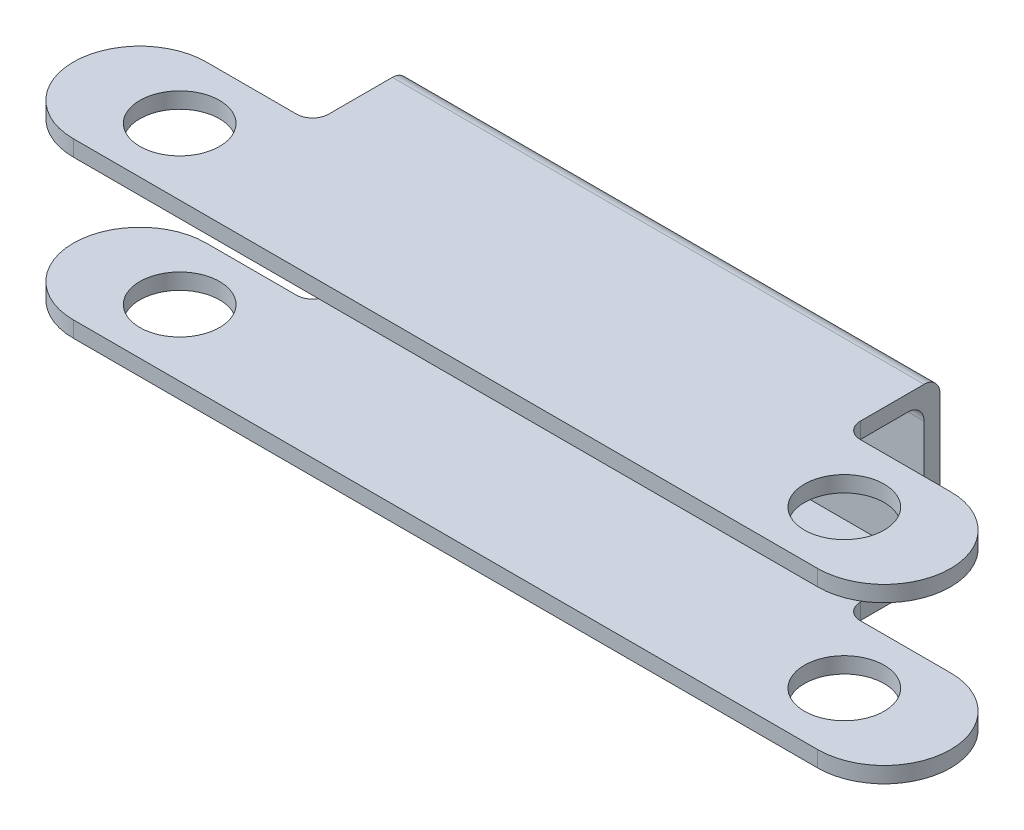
ISO-10303-21;
HEADER;
FILE_DESCRIPTION(('STEP AP214'),'2;1');
FILE_NAME('part.step','',(''),(''),'','','');
FILE_SCHEMA(('AUTOMOTIVE_DESIGN { 1 0 10303 214 1 1 1 1 }'));
ENDSEC;
DATA;
#1=APPLICATION_CONTEXT('core data for automotive mechanical design processes');
#2=APPLICATION_PROTOCOL_DEFINITION('international standard','automotive_design',2000,#1);
#3=PRODUCT_CONTEXT('',#1,'mechanical');
#4=PRODUCT('Part','Part','',(#3));
#5=PRODUCT_RELATED_PRODUCT_CATEGORY('part','',(#4));
#6=PRODUCT_DEFINITION_FORMATION('','',#4);
#7=PRODUCT_DEFINITION_CONTEXT('part definition',#1,'design');
#8=PRODUCT_DEFINITION('design','',#6,#7);
#9=PRODUCT_DEFINITION_SHAPE('','',#8);
#10=(LENGTH_UNIT() NAMED_UNIT(*) SI_UNIT(.MILLI.,.METRE.));
#11=(NAMED_UNIT(*) PLANE_ANGLE_UNIT() SI_UNIT($,.RADIAN.));
#12=(NAMED_UNIT(*) SI_UNIT($,.STERADIAN.) SOLID_ANGLE_UNIT());
#13=UNCERTAINTY_MEASURE_WITH_UNIT(LENGTH_MEASURE(1.E-05),#10,'distance_accuracy_value','');
#14=(GEOMETRIC_REPRESENTATION_CONTEXT(3) GLOBAL_UNCERTAINTY_ASSIGNED_CONTEXT((#13)) GLOBAL_UNIT_ASSIGNED_CONTEXT((#10,
#11,#12)) REPRESENTATION_CONTEXT('',''));
#15=CARTESIAN_POINT('',(0.,0.,0.));
#16=DIRECTION('',(0.,0.,1.));
#17=DIRECTION('',(1.,0.,0.));
#18=AXIS2_PLACEMENT_3D('',#15,#16,#17);
#19=CARTESIAN_POINT('',(-100.,-62.,-55.));
#20=DIRECTION('',(0.,0.,1.));
#21=DIRECTION('',(1.,0.,0.));
#22=AXIS2_PLACEMENT_3D('',#19,#20,#21);
#23=PLANE('',#22);
#24=DIRECTION('',(0.,1.,0.));
#25=VECTOR('',#24,1.);
#26=CARTESIAN_POINT('',(-100.,-62.,-55.));
#27=LINE('',#26,#25);
#28=CARTESIAN_POINT('',(-100.,-53.,-55.));
#29=VERTEX_POINT('',#28);
#30=CARTESIAN_POINT('',(-100.,-6.,-55.));
#31=VERTEX_POINT('',#30);
#32=EDGE_CURVE('E34',#29,#31,#27,.T.);
#33=ORIENTED_EDGE('',*,*,#32,.F.);
#34=DIRECTION('',(-1.,0.,0.));
#35=VECTOR('',#34,1.);
#36=CARTESIAN_POINT('',(-100.,-53.,-55.));
#37=LINE('',#36,#35);
#38=CARTESIAN_POINT('',(100.,-53.,-55.));
#39=VERTEX_POINT('',#38);
#40=EDGE_CURVE('E254',#39,#29,#37,.T.);
#41=ORIENTED_EDGE('',*,*,#40,.F.);
#42=DIRECTION('',(0.,1.,0.));
#43=VECTOR('',#42,1.);
#44=CARTESIAN_POINT('',(100.,-62.,-55.));
#45=LINE('',#44,#43);
#46=CARTESIAN_POINT('',(100.,-6.,-55.));
#47=VERTEX_POINT('',#46);
#48=EDGE_CURVE('E309',#39,#47,#45,.T.);
#49=ORIENTED_EDGE('',*,*,#48,.T.);
#50=DIRECTION('',(-1.,0.,0.));
#51=VECTOR('',#50,1.);
#52=CARTESIAN_POINT('',(-100.,-6.,-55.));
#53=LINE('',#52,#51);
#54=EDGE_CURVE('E313',#47,#31,#53,.T.);
#55=ORIENTED_EDGE('',*,*,#54,.T.);
#56=EDGE_LOOP('',(#33,#41,#49,#55));
#57=FACE_BOUND('',#56,.T.);
#58=ADVANCED_FACE('F30',(#57),#23,.T.);
#59=CARTESIAN_POINT('',(-106.,6.,-31.));
#60=DIRECTION('',(0.,1.,0.));
#61=DIRECTION('',(0.,0.,1.));
#62=AXIS2_PLACEMENT_3D('',#59,#60,#61);
#63=PLANE('',#62);
#64=CARTESIAN_POINT('',(-125.,6.,0.));
#65=DIRECTION('',(0.,1.,0.));
#66=DIRECTION('',(0.,0.,1.));
#67=AXIS2_PLACEMENT_3D('',#64,#65,#66);
#68=CIRCLE('',#67,15.);
#69=CARTESIAN_POINT('',(-125.,6.,15.));
#70=VERTEX_POINT('',#69);
#71=EDGE_CURVE('E360',#70,#70,#68,.T.);
#72=ORIENTED_EDGE('',*,*,#71,.F.);
#73=EDGE_LOOP('',(#72));
#74=FACE_BOUND('',#73,.T.);
#75=DIRECTION('',(0.,0.,-1.));
#76=VECTOR('',#75,1.);
#77=CARTESIAN_POINT('',(100.,6.,-55.));
#78=LINE('',#77,#76);
#79=CARTESIAN_POINT('',(100.,6.,-31.));
#80=VERTEX_POINT('',#79);
#81=CARTESIAN_POINT('',(100.,6.,-55.));
#82=VERTEX_POINT('',#81);
#83=EDGE_CURVE('E420',#80,#82,#78,.T.);
#84=ORIENTED_EDGE('',*,*,#83,.T.);
#85=DIRECTION('',(-1.,0.,0.));
#86=VECTOR('',#85,1.);
#87=CARTESIAN_POINT('',(-106.,6.,-55.));
#88=LINE('',#87,#86);
#89=CARTESIAN_POINT('',(-100.,6.,-55.));
#90=VERTEX_POINT('',#89);
#91=EDGE_CURVE('E329',#82,#90,#88,.T.);
#92=ORIENTED_EDGE('',*,*,#91,.T.);
#93=DIRECTION('',(0.,0.,1.));
#94=VECTOR('',#93,1.);
#95=CARTESIAN_POINT('',(-100.,6.,-31.));
#96=LINE('',#95,#94);
#97=CARTESIAN_POINT('',(-100.,6.,-31.));
#98=VERTEX_POINT('',#97);
#99=EDGE_CURVE('E368',#90,#98,#96,.T.);
#100=ORIENTED_EDGE('',*,*,#99,.T.);
#101=CARTESIAN_POINT('',(-106.,6.,-31.));
#102=DIRECTION('',(0.,-1.,0.));
#103=DIRECTION('',(0.,0.,1.));
#104=AXIS2_PLACEMENT_3D('',#101,#102,#103);
#105=CIRCLE('',#104,5.99999999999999);
#106=CARTESIAN_POINT('',(-106.,6.,-25.));
#107=VERTEX_POINT('',#106);
#108=EDGE_CURVE('E317',#98,#107,#105,.T.);
#109=ORIENTED_EDGE('',*,*,#108,.T.);
#110=DIRECTION('',(-1.,0.,0.));
#111=VECTOR('',#110,1.);
#112=CARTESIAN_POINT('',(-140.,6.,-25.));
#113=LINE('',#112,#111);
#114=CARTESIAN_POINT('',(-140.,6.,-25.));
#115=VERTEX_POINT('',#114);
#116=EDGE_CURVE('E402',#107,#115,#113,.T.);
#117=ORIENTED_EDGE('',*,*,#116,.T.);
#118=CARTESIAN_POINT('',(-140.,6.,0.));
#119=DIRECTION('',(0.,1.,0.));
#120=DIRECTION('',(0.,0.,1.));
#121=AXIS2_PLACEMENT_3D('',#118,#119,#120);
#122=CIRCLE('',#121,25.);
#123=CARTESIAN_POINT('',(-140.,6.,25.));
#124=VERTEX_POINT('',#123);
#125=EDGE_CURVE('E408',#115,#124,#122,.T.);
#126=ORIENTED_EDGE('',*,*,#125,.T.);
#127=DIRECTION('',(1.,0.,0.));
#128=VECTOR('',#127,1.);
#129=CARTESIAN_POINT('',(-140.,6.,25.));
#130=LINE('',#129,#128);
#131=CARTESIAN_POINT('',(140.,6.,25.));
#132=VERTEX_POINT('',#131);
#133=EDGE_CURVE('E413',#124,#132,#130,.T.);
#134=ORIENTED_EDGE('',*,*,#133,.T.);
#135=CARTESIAN_POINT('',(140.,6.,0.));
#136=DIRECTION('',(0.,1.,0.));
#137=DIRECTION('',(0.,0.,1.));
#138=AXIS2_PLACEMENT_3D('',#135,#136,#137);
#139=CIRCLE('',#138,25.);
#140=CARTESIAN_POINT('',(140.,6.,-24.9999999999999));
#141=VERTEX_POINT('',#140);
#142=EDGE_CURVE('E415',#132,#141,#139,.T.);
#143=ORIENTED_EDGE('',*,*,#142,.T.);
#144=DIRECTION('',(-1.,0.,0.));
#145=VECTOR('',#144,1.);
#146=CARTESIAN_POINT('',(106.,6.,-25.));
#147=LINE('',#146,#145);
#148=CARTESIAN_POINT('',(106.,6.,-25.));
#149=VERTEX_POINT('',#148);
#150=EDGE_CURVE('E417',#141,#149,#147,.T.);
#151=ORIENTED_EDGE('',*,*,#150,.T.);
#152=CARTESIAN_POINT('',(106.,6.,-31.));
#153=DIRECTION('',(0.,-1.,0.));
#154=DIRECTION('',(0.,0.,1.));
#155=AXIS2_PLACEMENT_3D('',#152,#153,#154);
#156=CIRCLE('',#155,6.00000000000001);
#157=EDGE_CURVE('E419',#149,#80,#156,.T.);
#158=ORIENTED_EDGE('',*,*,#157,.T.);
#159=EDGE_LOOP('',(#84,#92,#100,#109,#117,#126,#134,#143,#151,#158));
#160=FACE_BOUND('',#159,.T.);
#161=CARTESIAN_POINT('',(125.,6.,0.));
#162=DIRECTION('',(0.,1.,0.));
#163=DIRECTION('',(0.,0.,1.));
#164=AXIS2_PLACEMENT_3D('',#161,#162,#163);
#165=CIRCLE('',#164,15.);
#166=CARTESIAN_POINT('',(125.,6.,15.));
#167=VERTEX_POINT('',#166);
#168=EDGE_CURVE('E771',#167,#167,#165,.T.);
#169=ORIENTED_EDGE('',*,*,#168,.F.);
#170=EDGE_LOOP('',(#169));
#171=FACE_BOUND('',#170,.T.);
#172=ADVANCED_FACE('F422',(#74,#160,#171),#63,.T.);
#173=CARTESIAN_POINT('',(-106.,0.,-31.));
#174=DIRECTION('',(0.,1.,0.));
#175=DIRECTION('',(0.,0.,1.));
#176=AXIS2_PLACEMENT_3D('',#173,#174,#175);
#177=PLANE('',#176);
#178=CARTESIAN_POINT('',(-125.,0.,0.));
#179=DIRECTION('',(0.,1.,0.));
#180=DIRECTION('',(0.,0.,1.));
#181=AXIS2_PLACEMENT_3D('',#178,#179,#180);
#182=CIRCLE('',#181,15.);
#183=CARTESIAN_POINT('',(-125.,0.,15.));
#184=VERTEX_POINT('',#183);
#185=EDGE_CURVE('E365',#184,#184,#182,.T.);
#186=ORIENTED_EDGE('',*,*,#185,.T.);
#187=EDGE_LOOP('',(#186));
#188=FACE_BOUND('',#187,.T.);
#189=DIRECTION('',(0.,0.,1.));
#190=VECTOR('',#189,1.);
#191=CARTESIAN_POINT('',(-100.,0.,-31.));
#192=LINE('',#191,#190);
#193=CARTESIAN_POINT('',(-100.,0.,-49.));
#194=VERTEX_POINT('',#193);
#195=CARTESIAN_POINT('',(-100.,0.,-31.));
#196=VERTEX_POINT('',#195);
#197=EDGE_CURVE('E314',#194,#196,#192,.T.);
#198=ORIENTED_EDGE('',*,*,#197,.F.);
#199=DIRECTION('',(-1.,0.,0.));
#200=VECTOR('',#199,1.);
#201=CARTESIAN_POINT('',(-106.,0.,-49.));
#202=LINE('',#201,#200);
#203=CARTESIAN_POINT('',(100.,0.,-49.));
#204=VERTEX_POINT('',#203);
#205=EDGE_CURVE('E56',#194,#204,#202,.F.);
#206=ORIENTED_EDGE('',*,*,#205,.T.);
#207=DIRECTION('',(0.,0.,-1.));
#208=VECTOR('',#207,1.);
#209=CARTESIAN_POINT('',(100.,0.,-55.));
#210=LINE('',#209,#208);
#211=CARTESIAN_POINT('',(100.,0.,-31.));
#212=VERTEX_POINT('',#211);
#213=EDGE_CURVE('E318',#212,#204,#210,.T.);
#214=ORIENTED_EDGE('',*,*,#213,.F.);
#215=CARTESIAN_POINT('',(106.,0.,-31.));
#216=DIRECTION('',(0.,-1.,0.));
#217=DIRECTION('',(0.,0.,1.));
#218=AXIS2_PLACEMENT_3D('',#215,#216,#217);
#219=CIRCLE('',#218,6.00000000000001);
#220=CARTESIAN_POINT('',(106.,0.,-25.));
#221=VERTEX_POINT('',#220);
#222=EDGE_CURVE('E326',#221,#212,#219,.T.);
#223=ORIENTED_EDGE('',*,*,#222,.F.);
#224=DIRECTION('',(-1.,0.,0.));
#225=VECTOR('',#224,1.);
#226=CARTESIAN_POINT('',(106.,0.,-25.));
#227=LINE('',#226,#225);
#228=CARTESIAN_POINT('',(140.,0.,-24.9999999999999));
#229=VERTEX_POINT('',#228);
#230=EDGE_CURVE('E376',#229,#221,#227,.T.);
#231=ORIENTED_EDGE('',*,*,#230,.F.);
#232=CARTESIAN_POINT('',(140.,0.,0.));
#233=DIRECTION('',(0.,1.,0.));
#234=DIRECTION('',(0.,0.,1.));
#235=AXIS2_PLACEMENT_3D('',#232,#233,#234);
#236=CIRCLE('',#235,25.);
#237=CARTESIAN_POINT('',(140.,0.,25.));
#238=VERTEX_POINT('',#237);
#239=EDGE_CURVE('E374',#238,#229,#236,.T.);
#240=ORIENTED_EDGE('',*,*,#239,.F.);
#241=DIRECTION('',(1.,0.,0.));
#242=VECTOR('',#241,1.);
#243=CARTESIAN_POINT('',(-140.,0.,25.));
#244=LINE('',#243,#242);
#245=CARTESIAN_POINT('',(-140.,0.,25.));
#246=VERTEX_POINT('',#245);
#247=EDGE_CURVE('E372',#246,#238,#244,.T.);
#248=ORIENTED_EDGE('',*,*,#247,.F.);
#249=CARTESIAN_POINT('',(-140.,0.,0.));
#250=DIRECTION('',(0.,1.,0.));
#251=DIRECTION('',(0.,0.,1.));
#252=AXIS2_PLACEMENT_3D('',#249,#250,#251);
#253=CIRCLE('',#252,25.);
#254=CARTESIAN_POINT('',(-140.,0.,-25.));
#255=VERTEX_POINT('',#254);
#256=EDGE_CURVE('E362',#255,#246,#253,.T.);
#257=ORIENTED_EDGE('',*,*,#256,.F.);
#258=DIRECTION('',(-1.,0.,0.));
#259=VECTOR('',#258,1.);
#260=CARTESIAN_POINT('',(-140.,0.,-25.));
#261=LINE('',#260,#259);
#262=CARTESIAN_POINT('',(-106.,0.,-25.));
#263=VERTEX_POINT('',#262);
#264=EDGE_CURVE('E356',#263,#255,#261,.T.);
#265=ORIENTED_EDGE('',*,*,#264,.F.);
#266=CARTESIAN_POINT('',(-106.,0.,-31.));
#267=DIRECTION('',(0.,-1.,0.));
#268=DIRECTION('',(0.,0.,1.));
#269=AXIS2_PLACEMENT_3D('',#266,#267,#268);
#270=CIRCLE('',#269,5.99999999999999);
#271=EDGE_CURVE('E354',#196,#263,#270,.T.);
#272=ORIENTED_EDGE('',*,*,#271,.F.);
#273=EDGE_LOOP('',(#198,#206,#214,#223,#231,#240,#248,#257,#265,#272));
#274=FACE_BOUND('',#273,.T.);
#275=CARTESIAN_POINT('',(125.,0.,0.));
#276=DIRECTION('',(0.,1.,0.));
#277=DIRECTION('',(0.,0.,1.));
#278=AXIS2_PLACEMENT_3D('',#275,#276,#277);
#279=CIRCLE('',#278,15.);
#280=CARTESIAN_POINT('',(125.,0.,15.));
#281=VERTEX_POINT('',#280);
#282=EDGE_CURVE('E298',#281,#281,#279,.T.);
#283=ORIENTED_EDGE('',*,*,#282,.T.);
#284=EDGE_LOOP('',(#283));
#285=FACE_BOUND('',#284,.T.);
#286=ADVANCED_FACE('F351',(#188,#274,#285),#177,.F.);
#287=CARTESIAN_POINT('',(-106.,6.,-31.));
#288=DIRECTION('',(0.,-1.,0.));
#289=DIRECTION('',(0.,0.,-1.));
#290=AXIS2_PLACEMENT_3D('',#287,#288,#289);
#291=CYLINDRICAL_SURFACE('',#290,5.99999999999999);
#292=ORIENTED_EDGE('',*,*,#271,.T.);
#293=DIRECTION('',(0.,-1.,0.));
#294=VECTOR('',#293,1.);
#295=CARTESIAN_POINT('',(-106.,6.,-25.));
#296=LINE('',#295,#294);
#297=EDGE_CURVE('E323',#107,#263,#296,.T.);
#298=ORIENTED_EDGE('',*,*,#297,.F.);
#299=ORIENTED_EDGE('',*,*,#108,.F.);
#300=DIRECTION('',(0.,-1.,0.));
#301=VECTOR('',#300,1.);
#302=CARTESIAN_POINT('',(-100.,6.,-31.));
#303=LINE('',#302,#301);
#304=EDGE_CURVE('E379',#98,#196,#303,.T.);
#305=ORIENTED_EDGE('',*,*,#304,.T.);
#306=EDGE_LOOP('',(#292,#298,#299,#305));
#307=FACE_BOUND('',#306,.T.);
#308=ADVANCED_FACE('F405',(#307),#291,.F.);
#309=CARTESIAN_POINT('',(-140.,6.,-25.));
#310=DIRECTION('',(0.,0.,1.));
#311=DIRECTION('',(1.,0.,0.));
#312=AXIS2_PLACEMENT_3D('',#309,#310,#311);
#313=PLANE('',#312);
#314=ORIENTED_EDGE('',*,*,#264,.T.);
#315=DIRECTION('',(0.,-1.,0.));
#316=VECTOR('',#315,1.);
#317=CARTESIAN_POINT('',(-140.,6.,-25.));
#318=LINE('',#317,#316);
#319=EDGE_CURVE('E395',#115,#255,#318,.T.);
#320=ORIENTED_EDGE('',*,*,#319,.F.);
#321=ORIENTED_EDGE('',*,*,#116,.F.);
#322=ORIENTED_EDGE('',*,*,#297,.T.);
#323=EDGE_LOOP('',(#314,#320,#321,#322));
#324=FACE_BOUND('',#323,.T.);
#325=ADVANCED_FACE('F401',(#324),#313,.F.);
#326=CARTESIAN_POINT('',(-140.,6.,0.));
#327=DIRECTION('',(0.,-1.,0.));
#328=DIRECTION('',(0.,0.,-1.));
#329=AXIS2_PLACEMENT_3D('',#326,#327,#328);
#330=CYLINDRICAL_SURFACE('',#329,25.);
#331=ORIENTED_EDGE('',*,*,#256,.T.);
#332=DIRECTION('',(0.,-1.,0.));
#333=VECTOR('',#332,1.);
#334=CARTESIAN_POINT('',(-140.,6.,25.));
#335=LINE('',#334,#333);
#336=EDGE_CURVE('E393',#124,#246,#335,.T.);
#337=ORIENTED_EDGE('',*,*,#336,.F.);
#338=ORIENTED_EDGE('',*,*,#125,.F.);
#339=ORIENTED_EDGE('',*,*,#319,.T.);
#340=EDGE_LOOP('',(#331,#337,#338,#339));
#341=FACE_BOUND('',#340,.T.);
#342=ADVANCED_FACE('F505',(#341),#330,.T.);
#343=CARTESIAN_POINT('',(-140.,6.,25.));
#344=DIRECTION('',(0.,0.,-1.));
#345=DIRECTION('',(-1.,0.,0.));
#346=AXIS2_PLACEMENT_3D('',#343,#344,#345);
#347=PLANE('',#346);
#348=ORIENTED_EDGE('',*,*,#247,.T.);
#349=DIRECTION('',(0.,-1.,0.));
#350=VECTOR('',#349,1.);
#351=CARTESIAN_POINT('',(140.,6.,25.));
#352=LINE('',#351,#350);
#353=EDGE_CURVE('E390',#132,#238,#352,.T.);
#354=ORIENTED_EDGE('',*,*,#353,.F.);
#355=ORIENTED_EDGE('',*,*,#133,.F.);
#356=ORIENTED_EDGE('',*,*,#336,.T.);
#357=EDGE_LOOP('',(#348,#354,#355,#356));
#358=FACE_BOUND('',#357,.T.);
#359=ADVANCED_FACE('F502',(#358),#347,.F.);
#360=CARTESIAN_POINT('',(140.,6.,0.));
#361=DIRECTION('',(0.,-1.,0.));
#362=DIRECTION('',(0.,0.,-1.));
#363=AXIS2_PLACEMENT_3D('',#360,#361,#362);
#364=CYLINDRICAL_SURFACE('',#363,25.);
#365=ORIENTED_EDGE('',*,*,#239,.T.);
#366=DIRECTION('',(0.,-1.,0.));
#367=VECTOR('',#366,1.);
#368=CARTESIAN_POINT('',(140.,6.,-24.9999999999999));
#369=LINE('',#368,#367);
#370=EDGE_CURVE('E387',#141,#229,#369,.T.);
#371=ORIENTED_EDGE('',*,*,#370,.F.);
#372=ORIENTED_EDGE('',*,*,#142,.F.);
#373=ORIENTED_EDGE('',*,*,#353,.T.);
#374=EDGE_LOOP('',(#365,#371,#372,#373));
#375=FACE_BOUND('',#374,.T.);
#376=ADVANCED_FACE('F498',(#375),#364,.T.);
#377=CARTESIAN_POINT('',(106.,6.,-25.));
#378=DIRECTION('',(0.,0.,1.));
#379=DIRECTION('',(1.,0.,0.));
#380=AXIS2_PLACEMENT_3D('',#377,#378,#379);
#381=PLANE('',#380);
#382=ORIENTED_EDGE('',*,*,#230,.T.);
#383=DIRECTION('',(0.,-1.,0.));
#384=VECTOR('',#383,1.);
#385=CARTESIAN_POINT('',(106.,6.,-25.));
#386=LINE('',#385,#384);
#387=EDGE_CURVE('E384',#149,#221,#386,.T.);
#388=ORIENTED_EDGE('',*,*,#387,.F.);
#389=ORIENTED_EDGE('',*,*,#150,.F.);
#390=ORIENTED_EDGE('',*,*,#370,.T.);
#391=EDGE_LOOP('',(#382,#388,#389,#390));
#392=FACE_BOUND('',#391,.T.);
#393=ADVANCED_FACE('F494',(#392),#381,.F.);
#394=CARTESIAN_POINT('',(106.,6.,-31.));
#395=DIRECTION('',(0.,-1.,0.));
#396=DIRECTION('',(0.,0.,-1.));
#397=AXIS2_PLACEMENT_3D('',#394,#395,#396);
#398=CYLINDRICAL_SURFACE('',#397,6.00000000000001);
#399=ORIENTED_EDGE('',*,*,#222,.T.);
#400=DIRECTION('',(0.,-1.,0.));
#401=VECTOR('',#400,1.);
#402=CARTESIAN_POINT('',(100.,6.,-31.));
#403=LINE('',#402,#401);
#404=EDGE_CURVE('E381',#80,#212,#403,.T.);
#405=ORIENTED_EDGE('',*,*,#404,.F.);
#406=ORIENTED_EDGE('',*,*,#157,.F.);
#407=ORIENTED_EDGE('',*,*,#387,.T.);
#408=EDGE_LOOP('',(#399,#405,#406,#407));
#409=FACE_BOUND('',#408,.T.);
#410=ADVANCED_FACE('F489',(#409),#398,.F.);
#411=CARTESIAN_POINT('',(100.,6.,-55.));
#412=DIRECTION('',(-1.,0.,0.));
#413=DIRECTION('',(0.,0.,1.));
#414=AXIS2_PLACEMENT_3D('',#411,#412,#413);
#415=PLANE('',#414);
#416=DIRECTION('',(0.,1.,0.));
#417=VECTOR('',#416,1.);
#418=CARTESIAN_POINT('',(100.,-62.,-61.));
#419=LINE('',#418,#417);
#420=CARTESIAN_POINT('',(100.,-62.,-61.));
#421=VERTEX_POINT('',#420);
#422=CARTESIAN_POINT('',(100.,0.,-61.));
#423=VERTEX_POINT('',#422);
#424=EDGE_CURVE('E299',#421,#423,#419,.T.);
#425=ORIENTED_EDGE('',*,*,#424,.T.);
#426=CARTESIAN_POINT('',(100.,0.,-55.));
#427=DIRECTION('',(-1.,0.,0.));
#428=DIRECTION('',(0.,0.,1.));
#429=AXIS2_PLACEMENT_3D('',#426,#427,#428);
#430=CIRCLE('',#429,6.);
#431=EDGE_CURVE('E335',#423,#82,#430,.F.);
#432=ORIENTED_EDGE('',*,*,#431,.T.);
#433=ORIENTED_EDGE('',*,*,#83,.F.);
#434=ORIENTED_EDGE('',*,*,#404,.T.);
#435=ORIENTED_EDGE('',*,*,#213,.T.);
#436=CARTESIAN_POINT('',(100.,-6.,-49.));
#437=DIRECTION('',(-1.,0.,0.));
#438=DIRECTION('',(0.,0.,1.));
#439=AXIS2_PLACEMENT_3D('',#436,#437,#438);
#440=CIRCLE('',#439,6.);
#441=EDGE_CURVE('E11',#204,#47,#440,.T.);
#442=ORIENTED_EDGE('',*,*,#441,.T.);
#443=ORIENTED_EDGE('',*,*,#48,.F.);
#444=DIRECTION('',(0.,0.,-1.));
#445=VECTOR('',#444,1.);
#446=CARTESIAN_POINT('',(100.,-53.,-55.));
#447=LINE('',#446,#445);
#448=CARTESIAN_POINT('',(100.,-53.,-31.));
#449=VERTEX_POINT('',#448);
#450=EDGE_CURVE('E48',#449,#39,#447,.T.);
#451=ORIENTED_EDGE('',*,*,#450,.F.);
#452=DIRECTION('',(0.,1.,0.));
#453=VECTOR('',#452,1.);
#454=CARTESIAN_POINT('',(100.,-59.,-31.));
#455=LINE('',#454,#453);
#456=CARTESIAN_POINT('',(100.,-59.,-31.));
#457=VERTEX_POINT('',#456);
#458=EDGE_CURVE('E209',#457,#449,#455,.T.);
#459=ORIENTED_EDGE('',*,*,#458,.F.);
#460=DIRECTION('',(0.,0.,-1.));
#461=VECTOR('',#460,1.);
#462=CARTESIAN_POINT('',(100.,-59.,-55.));
#463=LINE('',#462,#461);
#464=CARTESIAN_POINT('',(100.,-59.,-55.));
#465=VERTEX_POINT('',#464);
#466=EDGE_CURVE('E227',#457,#465,#463,.T.);
#467=ORIENTED_EDGE('',*,*,#466,.T.);
#468=CARTESIAN_POINT('',(100.,-62.,-55.));
#469=VERTEX_POINT('',#468);
#470=EDGE_CURVE('E302',#469,#465,#45,.T.);
#471=ORIENTED_EDGE('',*,*,#470,.F.);
#472=DIRECTION('',(0.,0.,-1.));
#473=VECTOR('',#472,1.);
#474=CARTESIAN_POINT('',(100.,-62.,-55.));
#475=LINE('',#474,#473);
#476=EDGE_CURVE('E289',#469,#421,#475,.T.);
#477=ORIENTED_EDGE('',*,*,#476,.T.);
#478=EDGE_LOOP('',(#425,#432,#433,#434,#435,#442,#443,#451,#459,#467,#471,#477));
#479=FACE_BOUND('',#478,.T.);
#480=ADVANCED_FACE('F460',(#479),#415,.F.);
#481=CARTESIAN_POINT('',(-100.,6.,-31.));
#482=DIRECTION('',(1.,0.,0.));
#483=DIRECTION('',(0.,0.,-1.));
#484=AXIS2_PLACEMENT_3D('',#481,#482,#483);
#485=PLANE('',#484);
#486=ORIENTED_EDGE('',*,*,#99,.F.);
#487=CARTESIAN_POINT('',(-100.,0.,-55.));
#488=DIRECTION('',(1.,0.,0.));
#489=DIRECTION('',(0.,0.,-1.));
#490=AXIS2_PLACEMENT_3D('',#487,#488,#489);
#491=CIRCLE('',#490,6.);
#492=CARTESIAN_POINT('',(-100.,0.,-61.));
#493=VERTEX_POINT('',#492);
#494=EDGE_CURVE('E332',#90,#493,#491,.F.);
#495=ORIENTED_EDGE('',*,*,#494,.T.);
#496=DIRECTION('',(0.,1.,0.));
#497=VECTOR('',#496,1.);
#498=CARTESIAN_POINT('',(-100.,-62.,-61.));
#499=LINE('',#498,#497);
#500=CARTESIAN_POINT('',(-100.,-62.,-61.));
#501=VERTEX_POINT('',#500);
#502=EDGE_CURVE('E295',#501,#493,#499,.T.);
#503=ORIENTED_EDGE('',*,*,#502,.F.);
#504=DIRECTION('',(0.,0.,1.));
#505=VECTOR('',#504,1.);
#506=CARTESIAN_POINT('',(-100.,-62.,-55.));
#507=LINE('',#506,#505);
#508=CARTESIAN_POINT('',(-100.,-62.,-55.));
#509=VERTEX_POINT('',#508);
#510=EDGE_CURVE('E208',#501,#509,#507,.T.);
#511=ORIENTED_EDGE('',*,*,#510,.T.);
#512=CARTESIAN_POINT('',(-100.,-59.,-55.));
#513=VERTEX_POINT('',#512);
#514=EDGE_CURVE('E224',#509,#513,#27,.T.);
#515=ORIENTED_EDGE('',*,*,#514,.T.);
#516=DIRECTION('',(0.,0.,1.));
#517=VECTOR('',#516,1.);
#518=CARTESIAN_POINT('',(-100.,-59.,-31.));
#519=LINE('',#518,#517);
#520=CARTESIAN_POINT('',(-100.,-59.,-31.));
#521=VERTEX_POINT('',#520);
#522=EDGE_CURVE('E213',#513,#521,#519,.T.);
#523=ORIENTED_EDGE('',*,*,#522,.T.);
#524=DIRECTION('',(0.,1.,0.));
#525=VECTOR('',#524,1.);
#526=CARTESIAN_POINT('',(-100.,-59.,-31.));
#527=LINE('',#526,#525);
#528=CARTESIAN_POINT('',(-100.,-53.,-31.));
#529=VERTEX_POINT('',#528);
#530=EDGE_CURVE('E198',#521,#529,#527,.T.);
#531=ORIENTED_EDGE('',*,*,#530,.T.);
#532=DIRECTION('',(0.,0.,1.));
#533=VECTOR('',#532,1.);
#534=CARTESIAN_POINT('',(-100.,-53.,-31.));
#535=LINE('',#534,#533);
#536=EDGE_CURVE('E251',#29,#529,#535,.T.);
#537=ORIENTED_EDGE('',*,*,#536,.F.);
#538=ORIENTED_EDGE('',*,*,#32,.T.);
#539=CARTESIAN_POINT('',(-100.,-6.,-49.));
#540=DIRECTION('',(1.,0.,0.));
#541=DIRECTION('',(0.,0.,-1.));
#542=AXIS2_PLACEMENT_3D('',#539,#540,#541);
#543=CIRCLE('',#542,6.);
#544=EDGE_CURVE('E40',#31,#194,#543,.T.);
#545=ORIENTED_EDGE('',*,*,#544,.T.);
#546=ORIENTED_EDGE('',*,*,#197,.T.);
#547=ORIENTED_EDGE('',*,*,#304,.F.);
#548=EDGE_LOOP('',(#486,#495,#503,#511,#515,#523,#531,#537,#538,#545,#546,#547));
#549=FACE_BOUND('',#548,.T.);
#550=ADVANCED_FACE('F222',(#549),#485,.F.);
#551=CARTESIAN_POINT('',(-125.,6.,0.));
#552=DIRECTION('',(0.,-1.,0.));
#553=DIRECTION('',(0.,0.,-1.));
#554=AXIS2_PLACEMENT_3D('',#551,#552,#553);
#555=CYLINDRICAL_SURFACE('',#554,15.);
#556=ORIENTED_EDGE('',*,*,#71,.T.);
#557=EDGE_LOOP('',(#556));
#558=FACE_BOUND('',#557,.T.);
#559=ORIENTED_EDGE('',*,*,#185,.F.);
#560=EDGE_LOOP('',(#559));
#561=FACE_BOUND('',#560,.T.);
#562=ADVANCED_FACE('F528',(#558,#561),#555,.F.);
#563=CARTESIAN_POINT('',(125.,6.,0.));
#564=DIRECTION('',(0.,-1.,0.));
#565=DIRECTION('',(0.,0.,-1.));
#566=AXIS2_PLACEMENT_3D('',#563,#564,#565);
#567=CYLINDRICAL_SURFACE('',#566,15.);
#568=ORIENTED_EDGE('',*,*,#168,.T.);
#569=EDGE_LOOP('',(#568));
#570=FACE_BOUND('',#569,.T.);
#571=ORIENTED_EDGE('',*,*,#282,.F.);
#572=EDGE_LOOP('',(#571));
#573=FACE_BOUND('',#572,.T.);
#574=ADVANCED_FACE('F455',(#570,#573),#567,.F.);
#575=CARTESIAN_POINT('',(-100.,-62.,-61.));
#576=DIRECTION('',(0.,0.,-1.));
#577=DIRECTION('',(-1.,0.,0.));
#578=AXIS2_PLACEMENT_3D('',#575,#576,#577);
#579=PLANE('',#578);
#580=ORIENTED_EDGE('',*,*,#502,.T.);
#581=DIRECTION('',(-1.,0.,0.));
#582=VECTOR('',#581,1.);
#583=CARTESIAN_POINT('',(-100.,0.,-61.));
#584=LINE('',#583,#582);
#585=EDGE_CURVE('E334',#493,#423,#584,.F.);
#586=ORIENTED_EDGE('',*,*,#585,.T.);
#587=ORIENTED_EDGE('',*,*,#424,.F.);
#588=DIRECTION('',(-1.,0.,0.));
#589=VECTOR('',#588,1.);
#590=CARTESIAN_POINT('',(-100.,-62.,-61.));
#591=LINE('',#590,#589);
#592=EDGE_CURVE('E292',#421,#501,#591,.T.);
#593=ORIENTED_EDGE('',*,*,#592,.T.);
#594=EDGE_LOOP('',(#580,#586,#587,#593));
#595=FACE_BOUND('',#594,.T.);
#596=ADVANCED_FACE('F428',(#595),#579,.T.);
#597=DIRECTION('',(-1.,0.,0.));
#598=VECTOR('',#597,1.);
#599=CARTESIAN_POINT('',(-100.,-59.,-55.));
#600=LINE('',#599,#598);
#601=EDGE_CURVE('E225',#465,#513,#600,.T.);
#602=ORIENTED_EDGE('',*,*,#601,.T.);
#603=ORIENTED_EDGE('',*,*,#514,.F.);
#604=DIRECTION('',(1.,0.,0.));
#605=VECTOR('',#604,1.);
#606=CARTESIAN_POINT('',(-100.,-62.,-55.));
#607=LINE('',#606,#605);
#608=EDGE_CURVE('E286',#509,#469,#607,.T.);
#609=ORIENTED_EDGE('',*,*,#608,.T.);
#610=ORIENTED_EDGE('',*,*,#470,.T.);
#611=EDGE_LOOP('',(#602,#603,#609,#610));
#612=FACE_BOUND('',#611,.T.);
#613=ADVANCED_FACE('F437',(#612),#23,.T.);
#614=CARTESIAN_POINT('',(-100.,-62.,-61.));
#615=DIRECTION('',(0.,-1.,0.));
#616=DIRECTION('',(0.,0.,-1.));
#617=AXIS2_PLACEMENT_3D('',#614,#615,#616);
#618=PLANE('',#617);
#619=ORIENTED_EDGE('',*,*,#510,.F.);
#620=ORIENTED_EDGE('',*,*,#592,.F.);
#621=ORIENTED_EDGE('',*,*,#476,.F.);
#622=ORIENTED_EDGE('',*,*,#608,.F.);
#623=EDGE_LOOP('',(#619,#620,#621,#622));
#624=FACE_BOUND('',#623,.T.);
#625=ADVANCED_FACE('F432',(#624),#618,.T.);
#626=CARTESIAN_POINT('',(-106.,0.,-55.));
#627=DIRECTION('',(-1.,0.,0.));
#628=DIRECTION('',(0.,0.,1.));
#629=AXIS2_PLACEMENT_3D('',#626,#627,#628);
#630=CYLINDRICAL_SURFACE('',#629,6.);
#631=ORIENTED_EDGE('',*,*,#431,.F.);
#632=ORIENTED_EDGE('',*,*,#585,.F.);
#633=ORIENTED_EDGE('',*,*,#494,.F.);
#634=ORIENTED_EDGE('',*,*,#91,.F.);
#635=EDGE_LOOP('',(#631,#632,#633,#634));
#636=FACE_BOUND('',#635,.T.);
#637=ADVANCED_FACE('F430',(#636),#630,.T.);
#638=CARTESIAN_POINT('',(-100.,-6.,-49.));
#639=DIRECTION('',(-1.,0.,0.));
#640=DIRECTION('',(0.,0.,1.));
#641=AXIS2_PLACEMENT_3D('',#638,#639,#640);
#642=CYLINDRICAL_SURFACE('',#641,6.);
#643=ORIENTED_EDGE('',*,*,#441,.F.);
#644=ORIENTED_EDGE('',*,*,#205,.F.);
#645=ORIENTED_EDGE('',*,*,#544,.F.);
#646=ORIENTED_EDGE('',*,*,#54,.F.);
#647=EDGE_LOOP('',(#643,#644,#645,#646));
#648=FACE_BOUND('',#647,.T.);
#649=ADVANCED_FACE('F32',(#648),#642,.F.);
#650=CARTESIAN_POINT('',(-106.,-59.,-31.));
#651=DIRECTION('',(0.,1.,0.));
#652=DIRECTION('',(0.,0.,1.));
#653=AXIS2_PLACEMENT_3D('',#650,#651,#652);
#654=CYLINDRICAL_SURFACE('',#653,5.99999999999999);
#655=CARTESIAN_POINT('',(-106.,-53.,-31.));
#656=DIRECTION('',(0.,-1.,0.));
#657=DIRECTION('',(0.,0.,1.));
#658=AXIS2_PLACEMENT_3D('',#655,#656,#657);
#659=CIRCLE('',#658,5.99999999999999);
#660=CARTESIAN_POINT('',(-106.,-53.,-25.));
#661=VERTEX_POINT('',#660);
#662=EDGE_CURVE('E204',#529,#661,#659,.T.);
#663=ORIENTED_EDGE('',*,*,#662,.F.);
#664=ORIENTED_EDGE('',*,*,#530,.F.);
#665=CARTESIAN_POINT('',(-106.,-59.,-31.));
#666=DIRECTION('',(0.,-1.,0.));
#667=DIRECTION('',(0.,0.,1.));
#668=AXIS2_PLACEMENT_3D('',#665,#666,#667);
#669=CIRCLE('',#668,5.99999999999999);
#670=CARTESIAN_POINT('',(-106.,-59.,-25.));
#671=VERTEX_POINT('',#670);
#672=EDGE_CURVE('E201',#521,#671,#669,.T.);
#673=ORIENTED_EDGE('',*,*,#672,.T.);
#674=DIRECTION('',(0.,1.,0.));
#675=VECTOR('',#674,1.);
#676=CARTESIAN_POINT('',(-106.,-59.,-25.));
#677=LINE('',#676,#675);
#678=EDGE_CURVE('E249',#671,#661,#677,.T.);
#679=ORIENTED_EDGE('',*,*,#678,.T.);
#680=EDGE_LOOP('',(#663,#664,#673,#679));
#681=FACE_BOUND('',#680,.T.);
#682=ADVANCED_FACE('F200',(#681),#654,.F.);
#683=CARTESIAN_POINT('',(106.,-59.,-31.));
#684=DIRECTION('',(0.,1.,0.));
#685=DIRECTION('',(0.,0.,1.));
#686=AXIS2_PLACEMENT_3D('',#683,#684,#685);
#687=CYLINDRICAL_SURFACE('',#686,6.00000000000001);
#688=CARTESIAN_POINT('',(106.,-53.,-31.));
#689=DIRECTION('',(0.,-1.,0.));
#690=DIRECTION('',(0.,0.,1.));
#691=AXIS2_PLACEMENT_3D('',#688,#689,#690);
#692=CIRCLE('',#691,6.00000000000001);
#693=CARTESIAN_POINT('',(106.,-53.,-25.));
#694=VERTEX_POINT('',#693);
#695=EDGE_CURVE('E257',#694,#449,#692,.T.);
#696=ORIENTED_EDGE('',*,*,#695,.F.);
#697=DIRECTION('',(0.,1.,0.));
#698=VECTOR('',#697,1.);
#699=CARTESIAN_POINT('',(106.,-59.,-25.));
#700=LINE('',#699,#698);
#701=CARTESIAN_POINT('',(106.,-59.,-25.));
#702=VERTEX_POINT('',#701);
#703=EDGE_CURVE('E282',#702,#694,#700,.T.);
#704=ORIENTED_EDGE('',*,*,#703,.F.);
#705=CARTESIAN_POINT('',(106.,-59.,-31.));
#706=DIRECTION('',(0.,-1.,0.));
#707=DIRECTION('',(0.,0.,1.));
#708=AXIS2_PLACEMENT_3D('',#705,#706,#707);
#709=CIRCLE('',#708,6.00000000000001);
#710=EDGE_CURVE('E233',#702,#457,#709,.T.);
#711=ORIENTED_EDGE('',*,*,#710,.T.);
#712=ORIENTED_EDGE('',*,*,#458,.T.);
#713=EDGE_LOOP('',(#696,#704,#711,#712));
#714=FACE_BOUND('',#713,.T.);
#715=ADVANCED_FACE('F464',(#714),#687,.F.);
#716=CARTESIAN_POINT('',(106.,-59.,-25.));
#717=DIRECTION('',(0.,0.,-1.));
#718=DIRECTION('',(-1.,0.,0.));
#719=AXIS2_PLACEMENT_3D('',#716,#717,#718);
#720=PLANE('',#719);
#721=DIRECTION('',(-1.,0.,0.));
#722=VECTOR('',#721,1.);
#723=CARTESIAN_POINT('',(106.,-53.,-25.));
#724=LINE('',#723,#722);
#725=CARTESIAN_POINT('',(140.,-53.,-24.9999999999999));
#726=VERTEX_POINT('',#725);
#727=EDGE_CURVE('E259',#726,#694,#724,.T.);
#728=ORIENTED_EDGE('',*,*,#727,.F.);
#729=DIRECTION('',(0.,1.,0.));
#730=VECTOR('',#729,1.);
#731=CARTESIAN_POINT('',(140.,-59.,-24.9999999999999));
#732=LINE('',#731,#730);
#733=CARTESIAN_POINT('',(140.,-59.,-24.9999999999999));
#734=VERTEX_POINT('',#733);
#735=EDGE_CURVE('E280',#734,#726,#732,.T.);
#736=ORIENTED_EDGE('',*,*,#735,.F.);
#737=DIRECTION('',(-1.,0.,0.));
#738=VECTOR('',#737,1.);
#739=CARTESIAN_POINT('',(106.,-59.,-25.));
#740=LINE('',#739,#738);
#741=EDGE_CURVE('E236',#734,#702,#740,.T.);
#742=ORIENTED_EDGE('',*,*,#741,.T.);
#743=ORIENTED_EDGE('',*,*,#703,.T.);
#744=EDGE_LOOP('',(#728,#736,#742,#743));
#745=FACE_BOUND('',#744,.T.);
#746=ADVANCED_FACE('F469',(#745),#720,.T.);
#747=CARTESIAN_POINT('',(140.,-59.,0.));
#748=DIRECTION('',(0.,1.,0.));
#749=DIRECTION('',(0.,0.,1.));
#750=AXIS2_PLACEMENT_3D('',#747,#748,#749);
#751=CYLINDRICAL_SURFACE('',#750,25.);
#752=CARTESIAN_POINT('',(140.,-53.,0.));
#753=DIRECTION('',(0.,1.,0.));
#754=DIRECTION('',(0.,0.,1.));
#755=AXIS2_PLACEMENT_3D('',#752,#753,#754);
#756=CIRCLE('',#755,25.);
#757=CARTESIAN_POINT('',(140.,-53.,25.));
#758=VERTEX_POINT('',#757);
#759=EDGE_CURVE('E262',#758,#726,#756,.T.);
#760=ORIENTED_EDGE('',*,*,#759,.F.);
#761=DIRECTION('',(0.,1.,0.));
#762=VECTOR('',#761,1.);
#763=CARTESIAN_POINT('',(140.,-59.,25.));
#764=LINE('',#763,#762);
#765=CARTESIAN_POINT('',(140.,-59.,25.));
#766=VERTEX_POINT('',#765);
#767=EDGE_CURVE('E278',#766,#758,#764,.T.);
#768=ORIENTED_EDGE('',*,*,#767,.F.);
#769=CARTESIAN_POINT('',(140.,-59.,0.));
#770=DIRECTION('',(0.,1.,0.));
#771=DIRECTION('',(0.,0.,1.));
#772=AXIS2_PLACEMENT_3D('',#769,#770,#771);
#773=CIRCLE('',#772,25.);
#774=EDGE_CURVE('E239',#766,#734,#773,.T.);
#775=ORIENTED_EDGE('',*,*,#774,.T.);
#776=ORIENTED_EDGE('',*,*,#735,.T.);
#777=EDGE_LOOP('',(#760,#768,#775,#776));
#778=FACE_BOUND('',#777,.T.);
#779=ADVANCED_FACE('F472',(#778),#751,.T.);
#780=CARTESIAN_POINT('',(-140.,-59.,25.));
#781=DIRECTION('',(0.,0.,1.));
#782=DIRECTION('',(1.,0.,0.));
#783=AXIS2_PLACEMENT_3D('',#780,#781,#782);
#784=PLANE('',#783);
#785=DIRECTION('',(1.,0.,0.));
#786=VECTOR('',#785,1.);
#787=CARTESIAN_POINT('',(-140.,-53.,25.));
#788=LINE('',#787,#786);
#789=CARTESIAN_POINT('',(-140.,-53.,25.));
#790=VERTEX_POINT('',#789);
#791=EDGE_CURVE('E265',#790,#758,#788,.T.);
#792=ORIENTED_EDGE('',*,*,#791,.F.);
#793=DIRECTION('',(0.,1.,0.));
#794=VECTOR('',#793,1.);
#795=CARTESIAN_POINT('',(-140.,-59.,25.));
#796=LINE('',#795,#794);
#797=CARTESIAN_POINT('',(-140.,-59.,25.));
#798=VERTEX_POINT('',#797);
#799=EDGE_CURVE('E276',#798,#790,#796,.T.);
#800=ORIENTED_EDGE('',*,*,#799,.F.);
#801=DIRECTION('',(1.,0.,0.));
#802=VECTOR('',#801,1.);
#803=CARTESIAN_POINT('',(-140.,-59.,25.));
#804=LINE('',#803,#802);
#805=EDGE_CURVE('E242',#798,#766,#804,.T.);
#806=ORIENTED_EDGE('',*,*,#805,.T.);
#807=ORIENTED_EDGE('',*,*,#767,.T.);
#808=EDGE_LOOP('',(#792,#800,#806,#807));
#809=FACE_BOUND('',#808,.T.);
#810=ADVANCED_FACE('F476',(#809),#784,.T.);
#811=CARTESIAN_POINT('',(-140.,-59.,0.));
#812=DIRECTION('',(0.,1.,0.));
#813=DIRECTION('',(0.,0.,1.));
#814=AXIS2_PLACEMENT_3D('',#811,#812,#813);
#815=CYLINDRICAL_SURFACE('',#814,25.);
#816=CARTESIAN_POINT('',(-140.,-53.,0.));
#817=DIRECTION('',(0.,1.,0.));
#818=DIRECTION('',(0.,0.,1.));
#819=AXIS2_PLACEMENT_3D('',#816,#817,#818);
#820=CIRCLE('',#819,25.);
#821=CARTESIAN_POINT('',(-140.,-53.,-25.));
#822=VERTEX_POINT('',#821);
#823=EDGE_CURVE('E268',#822,#790,#820,.T.);
#824=ORIENTED_EDGE('',*,*,#823,.F.);
#825=DIRECTION('',(0.,1.,0.));
#826=VECTOR('',#825,1.);
#827=CARTESIAN_POINT('',(-140.,-59.,-25.));
#828=LINE('',#827,#826);
#829=CARTESIAN_POINT('',(-140.,-59.,-25.));
#830=VERTEX_POINT('',#829);
#831=EDGE_CURVE('E274',#830,#822,#828,.T.);
#832=ORIENTED_EDGE('',*,*,#831,.F.);
#833=CARTESIAN_POINT('',(-140.,-59.,0.));
#834=DIRECTION('',(0.,1.,0.));
#835=DIRECTION('',(0.,0.,1.));
#836=AXIS2_PLACEMENT_3D('',#833,#834,#835);
#837=CIRCLE('',#836,25.);
#838=EDGE_CURVE('E245',#830,#798,#837,.T.);
#839=ORIENTED_EDGE('',*,*,#838,.T.);
#840=ORIENTED_EDGE('',*,*,#799,.T.);
#841=EDGE_LOOP('',(#824,#832,#839,#840));
#842=FACE_BOUND('',#841,.T.);
#843=ADVANCED_FACE('F479',(#842),#815,.T.);
#844=CARTESIAN_POINT('',(-140.,-59.,-25.));
#845=DIRECTION('',(0.,0.,-1.));
#846=DIRECTION('',(-1.,0.,0.));
#847=AXIS2_PLACEMENT_3D('',#844,#845,#846);
#848=PLANE('',#847);
#849=DIRECTION('',(-1.,0.,0.));
#850=VECTOR('',#849,1.);
#851=CARTESIAN_POINT('',(-140.,-53.,-25.));
#852=LINE('',#851,#850);
#853=EDGE_CURVE('E218',#661,#822,#852,.T.);
#854=ORIENTED_EDGE('',*,*,#853,.F.);
#855=ORIENTED_EDGE('',*,*,#678,.F.);
#856=DIRECTION('',(-1.,0.,0.));
#857=VECTOR('',#856,1.);
#858=CARTESIAN_POINT('',(-140.,-59.,-25.));
#859=LINE('',#858,#857);
#860=EDGE_CURVE('E217',#671,#830,#859,.T.);
#861=ORIENTED_EDGE('',*,*,#860,.T.);
#862=ORIENTED_EDGE('',*,*,#831,.T.);
#863=EDGE_LOOP('',(#854,#855,#861,#862));
#864=FACE_BOUND('',#863,.T.);
#865=ADVANCED_FACE('F482',(#864),#848,.T.);
#866=CARTESIAN_POINT('',(-106.,-59.,-31.));
#867=DIRECTION('',(0.,-1.,0.));
#868=DIRECTION('',(0.,0.,1.));
#869=AXIS2_PLACEMENT_3D('',#866,#867,#868);
#870=PLANE('',#869);
#871=CARTESIAN_POINT('',(125.,-59.,0.));
#872=DIRECTION('',(0.,1.,0.));
#873=DIRECTION('',(0.,0.,1.));
#874=AXIS2_PLACEMENT_3D('',#871,#872,#873);
#875=CIRCLE('',#874,15.);
#876=CARTESIAN_POINT('',(125.,-59.,15.));
#877=VERTEX_POINT('',#876);
#878=EDGE_CURVE('E710',#877,#877,#875,.T.);
#879=ORIENTED_EDGE('',*,*,#878,.T.);
#880=EDGE_LOOP('',(#879));
#881=FACE_BOUND('',#880,.T.);
#882=CARTESIAN_POINT('',(-125.,-59.,0.));
#883=DIRECTION('',(0.,1.,0.));
#884=DIRECTION('',(0.,0.,1.));
#885=AXIS2_PLACEMENT_3D('',#882,#883,#884);
#886=CIRCLE('',#885,15.);
#887=CARTESIAN_POINT('',(-125.,-59.,15.));
#888=VERTEX_POINT('',#887);
#889=EDGE_CURVE('E252',#888,#888,#886,.T.);
#890=ORIENTED_EDGE('',*,*,#889,.T.);
#891=EDGE_LOOP('',(#890));
#892=FACE_BOUND('',#891,.T.);
#893=ORIENTED_EDGE('',*,*,#672,.F.);
#894=ORIENTED_EDGE('',*,*,#522,.F.);
#895=ORIENTED_EDGE('',*,*,#601,.F.);
#896=ORIENTED_EDGE('',*,*,#466,.F.);
#897=ORIENTED_EDGE('',*,*,#710,.F.);
#898=ORIENTED_EDGE('',*,*,#741,.F.);
#899=ORIENTED_EDGE('',*,*,#774,.F.);
#900=ORIENTED_EDGE('',*,*,#805,.F.);
#901=ORIENTED_EDGE('',*,*,#838,.F.);
#902=ORIENTED_EDGE('',*,*,#860,.F.);
#903=EDGE_LOOP('',(#893,#894,#895,#896,#897,#898,#899,#900,#901,#902));
#904=FACE_BOUND('',#903,.T.);
#905=ADVANCED_FACE('F212',(#881,#892,#904),#870,.T.);
#906=CARTESIAN_POINT('',(-106.,-53.,-31.));
#907=DIRECTION('',(0.,-1.,0.));
#908=DIRECTION('',(0.,0.,1.));
#909=AXIS2_PLACEMENT_3D('',#906,#907,#908);
#910=PLANE('',#909);
#911=CARTESIAN_POINT('',(125.,-53.,0.));
#912=DIRECTION('',(0.,1.,0.));
#913=DIRECTION('',(0.,0.,1.));
#914=AXIS2_PLACEMENT_3D('',#911,#912,#913);
#915=CIRCLE('',#914,15.);
#916=CARTESIAN_POINT('',(125.,-53.,15.));
#917=VERTEX_POINT('',#916);
#918=EDGE_CURVE('E713',#917,#917,#915,.T.);
#919=ORIENTED_EDGE('',*,*,#918,.F.);
#920=EDGE_LOOP('',(#919));
#921=FACE_BOUND('',#920,.T.);
#922=CARTESIAN_POINT('',(-125.,-53.,0.));
#923=DIRECTION('',(0.,1.,0.));
#924=DIRECTION('',(0.,0.,1.));
#925=AXIS2_PLACEMENT_3D('',#922,#923,#924);
#926=CIRCLE('',#925,15.);
#927=CARTESIAN_POINT('',(-125.,-53.,15.));
#928=VERTEX_POINT('',#927);
#929=EDGE_CURVE('E715',#928,#928,#926,.T.);
#930=ORIENTED_EDGE('',*,*,#929,.F.);
#931=EDGE_LOOP('',(#930));
#932=FACE_BOUND('',#931,.T.);
#933=ORIENTED_EDGE('',*,*,#662,.T.);
#934=ORIENTED_EDGE('',*,*,#853,.T.);
#935=ORIENTED_EDGE('',*,*,#823,.T.);
#936=ORIENTED_EDGE('',*,*,#791,.T.);
#937=ORIENTED_EDGE('',*,*,#759,.T.);
#938=ORIENTED_EDGE('',*,*,#727,.T.);
#939=ORIENTED_EDGE('',*,*,#695,.T.);
#940=ORIENTED_EDGE('',*,*,#450,.T.);
#941=ORIENTED_EDGE('',*,*,#40,.T.);
#942=ORIENTED_EDGE('',*,*,#536,.T.);
#943=EDGE_LOOP('',(#933,#934,#935,#936,#937,#938,#939,#940,#941,#942));
#944=FACE_BOUND('',#943,.T.);
#945=ADVANCED_FACE('F483',(#921,#932,#944),#910,.F.);
#946=CARTESIAN_POINT('',(-125.,-59.,0.));
#947=DIRECTION('',(0.,1.,0.));
#948=DIRECTION('',(0.,0.,1.));
#949=AXIS2_PLACEMENT_3D('',#946,#947,#948);
#950=CYLINDRICAL_SURFACE('',#949,15.);
#951=ORIENTED_EDGE('',*,*,#889,.F.);
#952=EDGE_LOOP('',(#951));
#953=FACE_BOUND('',#952,.T.);
#954=ORIENTED_EDGE('',*,*,#929,.T.);
#955=EDGE_LOOP('',(#954));
#956=FACE_BOUND('',#955,.T.);
#957=ADVANCED_FACE('F676',(#953,#956),#950,.F.);
#958=CARTESIAN_POINT('',(125.,-59.,0.));
#959=DIRECTION('',(0.,1.,0.));
#960=DIRECTION('',(0.,0.,1.));
#961=AXIS2_PLACEMENT_3D('',#958,#959,#960);
#962=CYLINDRICAL_SURFACE('',#961,15.);
#963=ORIENTED_EDGE('',*,*,#878,.F.);
#964=EDGE_LOOP('',(#963));
#965=FACE_BOUND('',#964,.T.);
#966=ORIENTED_EDGE('',*,*,#918,.T.);
#967=EDGE_LOOP('',(#966));
#968=FACE_BOUND('',#967,.T.);
#969=ADVANCED_FACE('F685',(#965,#968),#962,.F.);
#970=CLOSED_SHELL('',(#58,#172,#286,#308,#325,#342,#359,#376,#393,#410,#480,#550,#562,#574,#596,
#613,#625,#637,#649,#682,#715,#746,#779,#810,#843,#865,#905,#945,#957,#969));
#971=MANIFOLD_SOLID_BREP('B2',#970);
#972=ADVANCED_BREP_SHAPE_REPRESENTATION('',(#18,#971),#14);
#973=SHAPE_DEFINITION_REPRESENTATION(#9,#972);
ENDSEC;
END-ISO-10303-21;
